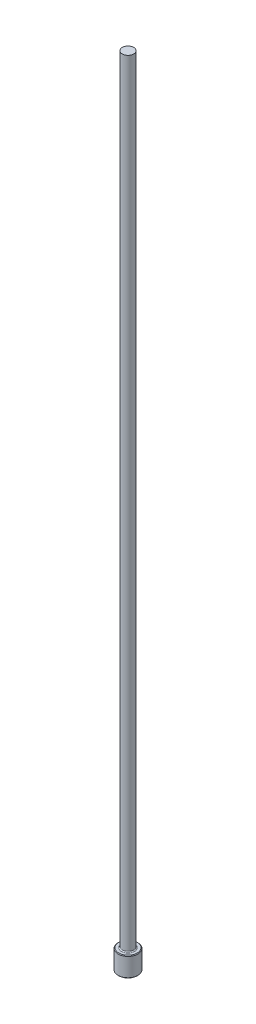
ISO-10303-21;
HEADER;
FILE_DESCRIPTION(('STEP AP214'),'2;1');
FILE_NAME('part.step','',(''),(''),'','','');
FILE_SCHEMA(('AUTOMOTIVE_DESIGN { 1 0 10303 214 1 1 1 1 }'));
ENDSEC;
DATA;
#1=APPLICATION_CONTEXT('core data for automotive mechanical design processes');
#2=APPLICATION_PROTOCOL_DEFINITION('international standard','automotive_design',2000,#1);
#3=PRODUCT_CONTEXT('',#1,'mechanical');
#4=PRODUCT('Part','Part','',(#3));
#5=PRODUCT_RELATED_PRODUCT_CATEGORY('part','',(#4));
#6=PRODUCT_DEFINITION_FORMATION('','',#4);
#7=PRODUCT_DEFINITION_CONTEXT('part definition',#1,'design');
#8=PRODUCT_DEFINITION('design','',#6,#7);
#9=PRODUCT_DEFINITION_SHAPE('','',#8);
#10=(LENGTH_UNIT() NAMED_UNIT(*) SI_UNIT(.MILLI.,.METRE.));
#11=(NAMED_UNIT(*) PLANE_ANGLE_UNIT() SI_UNIT($,.RADIAN.));
#12=(NAMED_UNIT(*) SI_UNIT($,.STERADIAN.) SOLID_ANGLE_UNIT());
#13=UNCERTAINTY_MEASURE_WITH_UNIT(LENGTH_MEASURE(1.E-05),#10,'distance_accuracy_value','');
#14=(GEOMETRIC_REPRESENTATION_CONTEXT(3) GLOBAL_UNCERTAINTY_ASSIGNED_CONTEXT((#13)) GLOBAL_UNIT_ASSIGNED_CONTEXT((#10,
#11,#12)) REPRESENTATION_CONTEXT('',''));
#15=CARTESIAN_POINT('',(0.,0.,0.));
#16=DIRECTION('',(0.,0.,1.));
#17=DIRECTION('',(1.,0.,0.));
#18=AXIS2_PLACEMENT_3D('',#15,#16,#17);
#19=CARTESIAN_POINT('',(0.,0.,0.));
#20=DIRECTION('',(0.,-1.,0.));
#21=DIRECTION('',(0.,0.,-1.));
#22=AXIS2_PLACEMENT_3D('',#19,#20,#21);
#23=PLANE('',#22);
#24=CARTESIAN_POINT('',(0.,0.,0.));
#25=DIRECTION('',(0.,-1.,0.));
#26=DIRECTION('',(0.,0.,-1.));
#27=AXIS2_PLACEMENT_3D('',#24,#25,#26);
#28=CIRCLE('',#27,0.736599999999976);
#29=CARTESIAN_POINT('',(0.,0.,0.736599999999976));
#30=VERTEX_POINT('',#29);
#31=EDGE_CURVE('E46',#30,#30,#28,.T.);
#32=ORIENTED_EDGE('',*,*,#31,.T.);
#33=EDGE_LOOP('',(#32));
#34=FACE_BOUND('',#33,.T.);
#35=ADVANCED_FACE('F35',(#34),#23,.T.);
#36=CARTESIAN_POINT('',(0.,259.958771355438,0.));
#37=DIRECTION('',(0.,1.,0.));
#38=DIRECTION('',(0.,0.,1.));
#39=AXIS2_PLACEMENT_3D('',#36,#37,#38);
#40=CYLINDRICAL_SURFACE('',#39,0.787399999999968);
#41=CARTESIAN_POINT('',(0.,1.52399999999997,0.));
#42=DIRECTION('',(0.,1.,0.));
#43=DIRECTION('',(0.,0.,1.));
#44=AXIS2_PLACEMENT_3D('',#41,#42,#43);
#45=CIRCLE('',#44,0.787399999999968);
#46=CARTESIAN_POINT('',(0.,1.52399999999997,0.787399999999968));
#47=VERTEX_POINT('',#46);
#48=EDGE_CURVE('E50',#47,#47,#45,.F.);
#49=ORIENTED_EDGE('',*,*,#48,.T.);
#50=EDGE_LOOP('',(#49));
#51=FACE_BOUND('',#50,.T.);
#52=CARTESIAN_POINT('',(0.,0.050799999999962,0.));
#53=DIRECTION('',(0.,-1.,0.));
#54=DIRECTION('',(0.,0.,-1.));
#55=AXIS2_PLACEMENT_3D('',#52,#53,#54);
#56=CIRCLE('',#55,0.787399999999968);
#57=CARTESIAN_POINT('',(0.,0.050799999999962,0.787399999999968));
#58=VERTEX_POINT('',#57);
#59=EDGE_CURVE('E55',#58,#58,#56,.F.);
#60=ORIENTED_EDGE('',*,*,#59,.T.);
#61=EDGE_LOOP('',(#60));
#62=FACE_BOUND('',#61,.T.);
#63=ADVANCED_FACE('F77',(#51,#62),#40,.T.);
#64=CARTESIAN_POINT('',(-0.787399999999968,1.5748,0.));
#65=DIRECTION('',(0.,1.,0.));
#66=DIRECTION('',(0.,0.,1.));
#67=AXIS2_PLACEMENT_3D('',#64,#65,#66);
#68=PLANE('',#67);
#69=CARTESIAN_POINT('',(0.,1.5748,0.));
#70=DIRECTION('',(0.,1.,0.));
#71=DIRECTION('',(0.,0.,1.));
#72=AXIS2_PLACEMENT_3D('',#69,#70,#71);
#73=CIRCLE('',#72,0.533399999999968);
#74=CARTESIAN_POINT('',(0.,1.5748,0.533399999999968));
#75=VERTEX_POINT('',#74);
#76=EDGE_CURVE('E10',#75,#75,#73,.F.);
#77=ORIENTED_EDGE('',*,*,#76,.T.);
#78=EDGE_LOOP('',(#77));
#79=FACE_BOUND('',#78,.T.);
#80=CARTESIAN_POINT('',(0.,1.5748,0.));
#81=DIRECTION('',(0.,1.,0.));
#82=DIRECTION('',(0.,0.,1.));
#83=AXIS2_PLACEMENT_3D('',#80,#81,#82);
#84=CIRCLE('',#83,0.73659999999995);
#85=CARTESIAN_POINT('',(0.,1.5748,0.73659999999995));
#86=VERTEX_POINT('',#85);
#87=EDGE_CURVE('E58',#86,#86,#84,.T.);
#88=ORIENTED_EDGE('',*,*,#87,.T.);
#89=EDGE_LOOP('',(#88));
#90=FACE_BOUND('',#89,.T.);
#91=ADVANCED_FACE('F69',(#79,#90),#68,.T.);
#92=CARTESIAN_POINT('',(0.,259.958771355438,0.));
#93=DIRECTION('',(0.,1.,0.));
#94=DIRECTION('',(0.,0.,1.));
#95=AXIS2_PLACEMENT_3D('',#92,#93,#94);
#96=CYLINDRICAL_SURFACE('',#95,0.457199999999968);
#97=CARTESIAN_POINT('',(0.,1.65100000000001,0.));
#98=DIRECTION('',(0.,1.,0.));
#99=DIRECTION('',(0.,0.,1.));
#100=AXIS2_PLACEMENT_3D('',#97,#98,#99);
#101=CIRCLE('',#100,0.457199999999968);
#102=CARTESIAN_POINT('',(0.,1.65100000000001,0.457199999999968));
#103=VERTEX_POINT('',#102);
#104=EDGE_CURVE('E42',#103,#103,#101,.T.);
#105=ORIENTED_EDGE('',*,*,#104,.T.);
#106=EDGE_LOOP('',(#105));
#107=FACE_BOUND('',#106,.T.);
#108=CARTESIAN_POINT('',(0.,63.5,0.));
#109=DIRECTION('',(0.,1.,0.));
#110=DIRECTION('',(0.,0.,1.));
#111=AXIS2_PLACEMENT_3D('',#108,#109,#110);
#112=CIRCLE('',#111,0.457199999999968);
#113=CARTESIAN_POINT('',(0.,63.5,0.457199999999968));
#114=VERTEX_POINT('',#113);
#115=EDGE_CURVE('E61',#114,#114,#112,.T.);
#116=ORIENTED_EDGE('',*,*,#115,.F.);
#117=EDGE_LOOP('',(#116));
#118=FACE_BOUND('',#117,.T.);
#119=ADVANCED_FACE('F67',(#107,#118),#96,.T.);
#120=CARTESIAN_POINT('',(-0.457199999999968,63.5,0.));
#121=DIRECTION('',(0.,1.,0.));
#122=DIRECTION('',(0.,0.,1.));
#123=AXIS2_PLACEMENT_3D('',#120,#121,#122);
#124=PLANE('',#123);
#125=ORIENTED_EDGE('',*,*,#115,.T.);
#126=EDGE_LOOP('',(#125));
#127=FACE_BOUND('',#126,.T.);
#128=ADVANCED_FACE('F65',(#127),#124,.T.);
#129=CARTESIAN_POINT('',(0.,1.57479999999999,0.));
#130=DIRECTION('',(0.,-1.,0.));
#131=DIRECTION('',(0.,0.,-1.));
#132=AXIS2_PLACEMENT_3D('',#129,#130,#131);
#133=CONICAL_SURFACE('',#132,0.736599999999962,0.785398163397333);
#134=ORIENTED_EDGE('',*,*,#48,.F.);
#135=EDGE_LOOP('',(#134));
#136=FACE_BOUND('',#135,.T.);
#137=ORIENTED_EDGE('',*,*,#87,.F.);
#138=EDGE_LOOP('',(#137));
#139=FACE_BOUND('',#138,.T.);
#140=ADVANCED_FACE('F75',(#136,#139),#133,.T.);
#141=CARTESIAN_POINT('',(0.,0.050799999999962,0.));
#142=DIRECTION('',(0.,1.,0.));
#143=DIRECTION('',(0.,0.,1.));
#144=AXIS2_PLACEMENT_3D('',#141,#142,#143);
#145=CONICAL_SURFACE('',#144,0.787399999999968,0.785398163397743);
#146=CARTESIAN_POINT('',(0.,0.,0.736599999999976));
#147=CARTESIAN_POINT('',(0.,0.000529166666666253,0.737129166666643));
#148=CARTESIAN_POINT('',(0.,0.00105833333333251,0.737658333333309));
#149=CARTESIAN_POINT('',(0.,0.00211666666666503,0.738716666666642));
#150=CARTESIAN_POINT('',(0.,0.00264583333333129,0.739245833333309));
#151=CARTESIAN_POINT('',(0.,0.00370416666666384,0.740304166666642));
#152=CARTESIAN_POINT('',(0.,0.00423333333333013,0.740833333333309));
#153=CARTESIAN_POINT('',(0.,0.00529166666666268,0.741891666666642));
#154=CARTESIAN_POINT('',(0.,0.00582083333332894,0.742420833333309));
#155=CARTESIAN_POINT('',(0.,0.00687916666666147,0.743479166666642));
#156=CARTESIAN_POINT('',(0.,0.00740833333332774,0.744008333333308));
#157=CARTESIAN_POINT('',(0.,0.00846666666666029,0.745066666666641));
#158=CARTESIAN_POINT('',(0.,0.00899583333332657,0.745595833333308));
#159=CARTESIAN_POINT('',(0.,0.0100541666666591,0.746654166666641));
#160=CARTESIAN_POINT('',(0.,0.0105833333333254,0.747183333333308));
#161=CARTESIAN_POINT('',(0.,0.0116416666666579,0.748241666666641));
#162=CARTESIAN_POINT('',(0.,0.0121708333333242,0.748770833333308));
#163=CARTESIAN_POINT('',(0.,0.0132291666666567,0.749829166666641));
#164=CARTESIAN_POINT('',(0.,0.013758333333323,0.750358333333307));
#165=CARTESIAN_POINT('',(0.,0.0148166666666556,0.75141666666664));
#166=CARTESIAN_POINT('',(0.,0.0153458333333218,0.751945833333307));
#167=CARTESIAN_POINT('',(0.,0.0164041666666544,0.75300416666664));
#168=CARTESIAN_POINT('',(0.,0.0169333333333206,0.753533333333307));
#169=CARTESIAN_POINT('',(0.,0.0179916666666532,0.75459166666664));
#170=CARTESIAN_POINT('',(0.,0.0185208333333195,0.755120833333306));
#171=CARTESIAN_POINT('',(0.,0.019579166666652,0.75617916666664));
#172=CARTESIAN_POINT('',(0.,0.0201083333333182,0.756708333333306));
#173=CARTESIAN_POINT('',(0.,0.0211666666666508,0.757766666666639));
#174=CARTESIAN_POINT('',(0.,0.0216958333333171,0.758295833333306));
#175=CARTESIAN_POINT('',(0.,0.0227541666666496,0.759354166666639));
#176=CARTESIAN_POINT('',(0.,0.0232833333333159,0.759883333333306));
#177=CARTESIAN_POINT('',(0.,0.0243416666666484,0.760941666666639));
#178=CARTESIAN_POINT('',(0.,0.0248708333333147,0.761470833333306));
#179=CARTESIAN_POINT('',(0.,0.0259291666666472,0.762529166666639));
#180=CARTESIAN_POINT('',(0.,0.0264583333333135,0.763058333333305));
#181=CARTESIAN_POINT('',(0.,0.0275166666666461,0.764116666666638));
#182=CARTESIAN_POINT('',(0.,0.0280458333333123,0.764645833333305));
#183=CARTESIAN_POINT('',(0.,0.0291041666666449,0.765704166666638));
#184=CARTESIAN_POINT('',(0.,0.0296333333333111,0.766233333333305));
#185=CARTESIAN_POINT('',(0.,0.0306916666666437,0.767291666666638));
#186=CARTESIAN_POINT('',(0.,0.03122083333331,0.767820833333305));
#187=CARTESIAN_POINT('',(0.,0.0322791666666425,0.768879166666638));
#188=CARTESIAN_POINT('',(0.,0.0328083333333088,0.769408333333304));
#189=CARTESIAN_POINT('',(0.,0.0338666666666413,0.770466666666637));
#190=CARTESIAN_POINT('',(0.,0.0343958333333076,0.770995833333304));
#191=CARTESIAN_POINT('',(0.,0.0354541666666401,0.772054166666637));
#192=CARTESIAN_POINT('',(0.,0.0359833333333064,0.772583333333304));
#193=CARTESIAN_POINT('',(0.,0.0370416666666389,0.773641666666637));
#194=CARTESIAN_POINT('',(0.,0.0375708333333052,0.774170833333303));
#195=CARTESIAN_POINT('',(0.,0.0386291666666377,0.775229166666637));
#196=CARTESIAN_POINT('',(0.,0.039158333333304,0.775758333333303));
#197=CARTESIAN_POINT('',(0.,0.0402166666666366,0.776816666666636));
#198=CARTESIAN_POINT('',(0.,0.0407458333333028,0.777345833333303));
#199=CARTESIAN_POINT('',(0.,0.0418041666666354,0.778404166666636));
#200=CARTESIAN_POINT('',(0.,0.0423333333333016,0.778933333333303));
#201=CARTESIAN_POINT('',(0.,0.0433916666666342,0.779991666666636));
#202=CARTESIAN_POINT('',(0.,0.0439208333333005,0.780520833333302));
#203=CARTESIAN_POINT('',(0.,0.044979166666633,0.781579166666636));
#204=CARTESIAN_POINT('',(0.,0.0455083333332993,0.782108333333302));
#205=CARTESIAN_POINT('',(0.,0.0465666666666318,0.783166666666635));
#206=CARTESIAN_POINT('',(0.,0.0470958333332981,0.783695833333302));
#207=CARTESIAN_POINT('',(0.,0.0481541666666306,0.784754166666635));
#208=CARTESIAN_POINT('',(0.,0.0486833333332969,0.785283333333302));
#209=CARTESIAN_POINT('',(0.,0.0497416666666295,0.786341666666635));
#210=CARTESIAN_POINT('',(0.,0.0502708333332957,0.786870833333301));
#211=CARTESIAN_POINT('',(0.,0.050799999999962,0.787399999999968));
#212=B_SPLINE_CURVE_WITH_KNOTS('',3,(#146,#147,#148,#149,#150,#151,#152,#153,#154,#155,#156,
#157,#158,#159,#160,#161,#162,#163,#164,#165,#166,#167,#168,#169,#170,#171,#172,#173,#174,#175,
#176,#177,#178,#179,#180,#181,#182,#183,#184,#185,#186,#187,#188,#189,#190,#191,#192,#193,#194,
#195,#196,#197,#198,#199,#200,#201,#202,#203,#204,#205,#206,#207,#208,#209,#210,#211),
.UNSPECIFIED.,.F.,.F.,(4,2,2,2,2,2,2,2,2,2,2,2,2,2,2,2,2,2,2,2,2,2,2,2,2,2,2,2,2,2,2,2,4),(0.,
0.00224506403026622,0.00449012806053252,0.00673519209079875,0.00898025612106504,
0.0112253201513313,0.0134703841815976,0.0157154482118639,0.0179605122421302,0.0202055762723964,
0.0224506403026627,0.024695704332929,0.0269407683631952,0.0291858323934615,0.0314308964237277,
0.033675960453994,0.0359210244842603,0.0381660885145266,0.0404111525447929,0.0426562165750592,
0.0449012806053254,0.0471463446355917,0.049391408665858,0.0516364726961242,0.0538815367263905,
0.0561266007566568,0.058371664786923,0.0606167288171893,0.0628617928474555,0.0651068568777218,
0.0673519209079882,0.0695969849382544,0.0718420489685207),.UNSPECIFIED.);
#213=EDGE_CURVE('BSEAM89',#30,#58,#212,.T.);
#214=ORIENTED_EDGE('',*,*,#31,.F.);
#215=ORIENTED_EDGE('',*,*,#59,.F.);
#216=ORIENTED_EDGE('',*,*,#213,.T.);
#217=ORIENTED_EDGE('',*,*,#213,.F.);
#218=EDGE_LOOP('',(#214,#216,#215,#217));
#219=FACE_BOUND('',#218,.T.);
#220=ADVANCED_FACE('F89',(#219),#145,.T.);
#221=CARTESIAN_POINT('',(0.,1.65100000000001,0.));
#222=DIRECTION('',(0.,1.,0.));
#223=DIRECTION('',(0.,0.,1.));
#224=AXIS2_PLACEMENT_3D('',#221,#222,#223);
#225=TOROIDAL_SURFACE('',#224,0.533399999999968,0.0762);
#226=ORIENTED_EDGE('',*,*,#76,.F.);
#227=EDGE_LOOP('',(#226));
#228=FACE_BOUND('',#227,.T.);
#229=ORIENTED_EDGE('',*,*,#104,.F.);
#230=EDGE_LOOP('',(#229));
#231=FACE_BOUND('',#230,.T.);
#232=ADVANCED_FACE('F37',(#228,#231),#225,.F.);
#233=CLOSED_SHELL('',(#35,#63,#91,#119,#128,#140,#220,#232));
#234=MANIFOLD_SOLID_BREP('B2',#233);
#235=ADVANCED_BREP_SHAPE_REPRESENTATION('',(#18,#234),#14);
#236=SHAPE_DEFINITION_REPRESENTATION(#9,#235);
ENDSEC;
END-ISO-10303-21;
